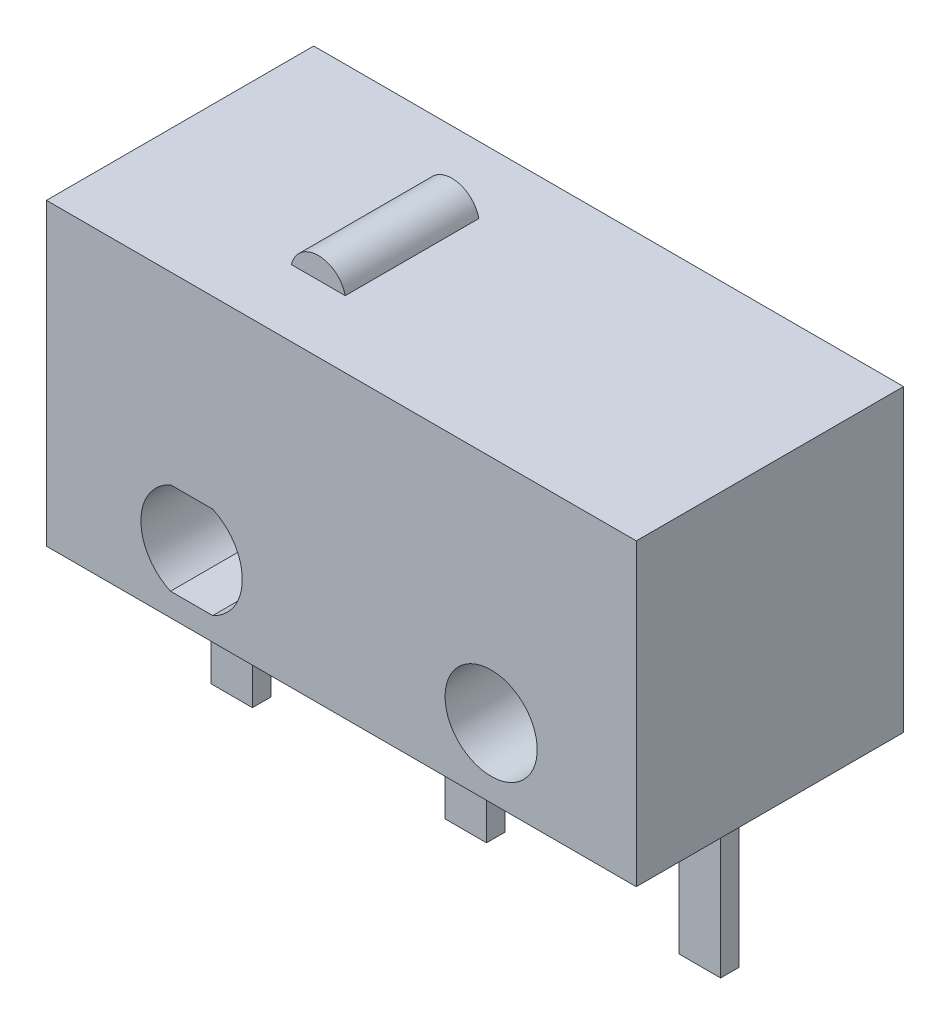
from build123d import *

# Parameters (mm, degrees)
SKETCH1_W          = 5.8
SKETCH1_H          = 6.5
EXTRUDE1_DEPTH     = 12.8
CUT_EXTRUDE1_DEPTH = 5.8
SKETCH3_R          = 1
CUT_EXTRUDE2_DEPTH = 5.8
SKETCH4_W          = 0.9
SKETCH4_H          = 0.4
EXTRUDE2_DEPTH     = 3.5
SKETCH5_W          = 0.9
SKETCH5_H          = 0.4
EXTRUDE3_DEPTH     = 3.5
SKETCH6_W          = 0.9
SKETCH6_H          = 0.4
EXTRUDE4_DEPTH     = 3.5
EXTRUDE5_DEPTH     = 2.9


with BuildPart() as part:
    # Sketch1 → Extrude1 (new body)
    with BuildSketch(Plane(origin=(3.15, 0, 0), x_dir=(0, 0, -1), z_dir=(1, 0, 0))):
        with Locations((0, 1.75)):
            Rectangle(SKETCH1_W, SKETCH1_H)
    extrude(amount=-EXTRUDE1_DEPTH)

    # Sketch2 → Cut-Extrude1 (cut)
    with BuildSketch(Plane.XY.offset(2.9)):
        with BuildLine():
            Line((-6.958257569, -1), (-6.041742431, -1))
            ThreePointArc((-6.041742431, -1), (-5.4, 0), (-6.041742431, 1))
            Line((-6.041742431, 1), (-6.958257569, 1))
            ThreePointArc((-6.958257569, 1), (-7.6, 0), (-6.958257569, -1))
        make_face()
    extrude(amount=-CUT_EXTRUDE1_DEPTH, mode=Mode.SUBTRACT)

    # Sketch3 → Cut-Extrude2 (cut)
    with BuildSketch(Plane.XY.offset(2.9)):
        with Locations(Location((0, 0, 0), (0, 0, 180))):
            Circle(SKETCH3_R)
    extrude(amount=-CUT_EXTRUDE2_DEPTH, mode=Mode.SUBTRACT)

    # Sketch4 → Extrude2 (add)
    with BuildSketch(Plane.XZ.offset(1.5)):
        with Locations((-8.33, 0)):
            Rectangle(SKETCH4_W, SKETCH4_H)
    extrude(amount=EXTRUDE2_DEPTH)

    # Sketch5 → Extrude3 (add)
    with BuildSketch(Plane.XZ.offset(1.5)):
        with Locations((-3.25, 0)):
            Rectangle(SKETCH5_W, SKETCH5_H)
    extrude(amount=EXTRUDE3_DEPTH)

    # Sketch6 → Extrude4 (add)
    with BuildSketch(Plane.XZ.offset(1.5)):
        with Locations((1.83, 0)):
            Rectangle(SKETCH6_W, SKETCH6_H)
    extrude(amount=EXTRUDE4_DEPTH)

    # Sketch7 → Extrude5 (add)
    with BuildSketch(Plane(origin=(0, 0, -1.45), x_dir=(-1, 0, 0), z_dir=(0, 0, -1))):
        with BuildLine():
            Line((4.615606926, 5), (5.784393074, 5))
            ThreePointArc((5.784393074, 5), (5.2, 5.464041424), (4.615606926, 5))
        make_face()
    extrude(amount=-EXTRUDE5_DEPTH)


solid = part.part
